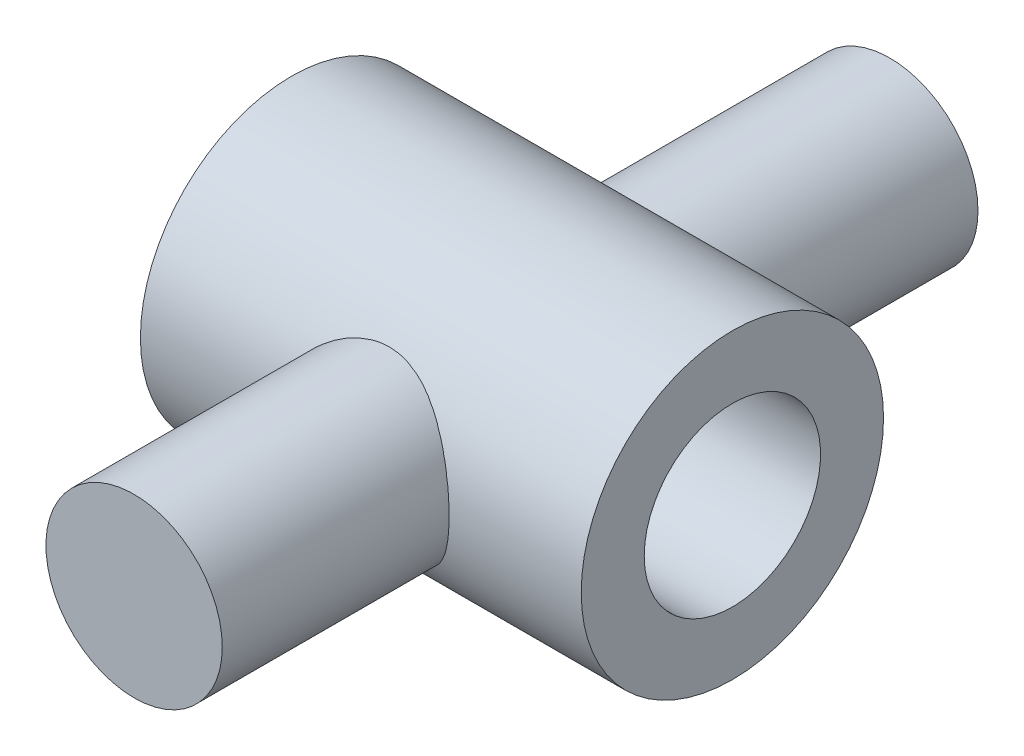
from build123d import *

# Parameters (mm, degrees)
SKETCH1_W          = 35
SKETCH1_H          = 5
SKETCH2_R          = 7
EXTRUDE2_DEPTH     = 30
SKETCH3_R          = 7
CUT_EXTRUDE1_DEPTH = 48.634021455


with BuildPart() as part:
    # Sketch1 → Revolve1 (revolve)
    with BuildSketch(Plane.XY, mode=Mode.PRIVATE) as revolve1_sk:
        with Locations((0, 9.5)):
            Rectangle(SKETCH1_W, SKETCH1_H)
    revolve(revolve1_sk.sketch.rotate(Axis((0, 0, 0), (1, 0, 0)), 90), axis=Axis((0, 0, 0), (1, 0, 0)))


with BuildPart() as body_2:
    # Sketch2 → Extrude2 (new, symmetric)
    with BuildSketch(Plane.XY):
        with Locations(Location((0, 0, 0), (0, 0, 180))):
            Circle(SKETCH2_R)
    extrude(amount=EXTRUDE2_DEPTH, both=True)

    # Sketch3 → Cut-Extrude1 (cut, through all)
    with BuildSketch(Plane(origin=(17.5, 0, 0), x_dir=(0, 0, -1), z_dir=(1, 0, 0))):
        with Locations(Location((0, 0, 0), (0, 0, 180))):
            Circle(SKETCH3_R)
    extrude(amount=-CUT_EXTRUDE1_DEPTH, mode=Mode.SUBTRACT)


with BuildPart() as cut_extrude1_piece_1:
    # of the separate pieces the step leaves, piece 1, a body of its own (cut_extrude1_pieces)
    add(body_2.part.solids().sort_by_distance((-7, 0, 7))[0])


with BuildPart() as cut_extrude1_piece_2:
    # of the separate pieces the step leaves, piece 2, a body of its own (cut_extrude1_pieces)
    add(body_2.part.solids().sort_by_distance((-7, 0, -30))[0])


solid = Compound([part.part, cut_extrude1_piece_1.part, cut_extrude1_piece_2.part])
